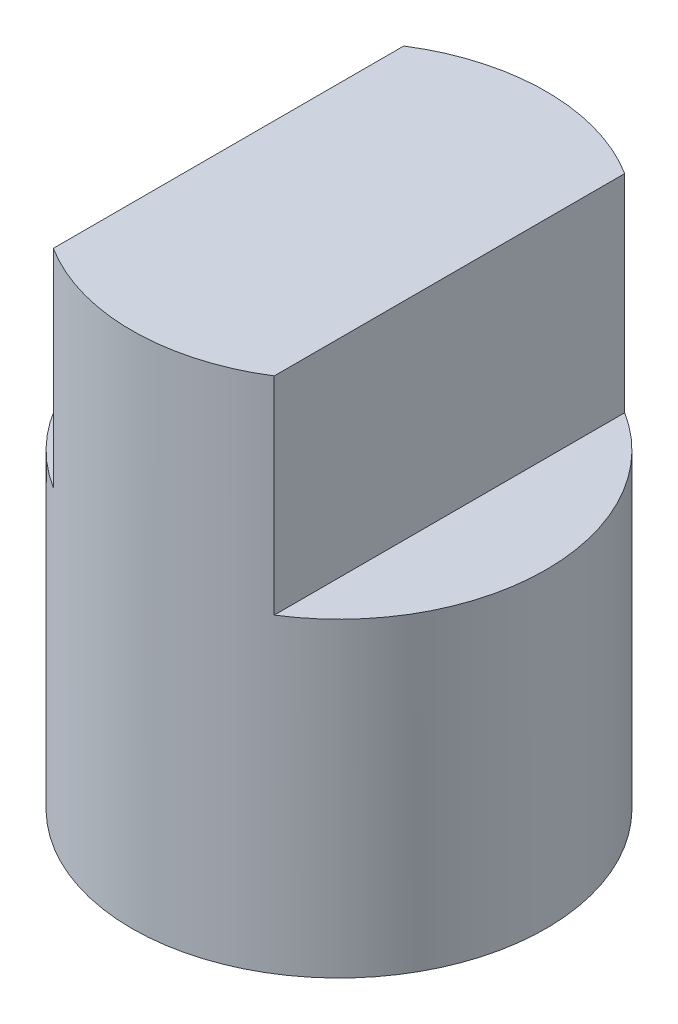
ISO-10303-21;
HEADER;
FILE_DESCRIPTION(('STEP AP214'),'2;1');
FILE_NAME('part.step','',(''),(''),'','','');
FILE_SCHEMA(('AUTOMOTIVE_DESIGN { 1 0 10303 214 1 1 1 1 }'));
ENDSEC;
DATA;
#1=APPLICATION_CONTEXT('core data for automotive mechanical design processes');
#2=APPLICATION_PROTOCOL_DEFINITION('international standard','automotive_design',2000,#1);
#3=PRODUCT_CONTEXT('',#1,'mechanical');
#4=PRODUCT('Part','Part','',(#3));
#5=PRODUCT_RELATED_PRODUCT_CATEGORY('part','',(#4));
#6=PRODUCT_DEFINITION_FORMATION('','',#4);
#7=PRODUCT_DEFINITION_CONTEXT('part definition',#1,'design');
#8=PRODUCT_DEFINITION('design','',#6,#7);
#9=PRODUCT_DEFINITION_SHAPE('','',#8);
#10=(LENGTH_UNIT() NAMED_UNIT(*) SI_UNIT(.MILLI.,.METRE.));
#11=(NAMED_UNIT(*) PLANE_ANGLE_UNIT() SI_UNIT($,.RADIAN.));
#12=(NAMED_UNIT(*) SI_UNIT($,.STERADIAN.) SOLID_ANGLE_UNIT());
#13=UNCERTAINTY_MEASURE_WITH_UNIT(LENGTH_MEASURE(1.E-05),#10,'distance_accuracy_value','');
#14=(GEOMETRIC_REPRESENTATION_CONTEXT(3) GLOBAL_UNCERTAINTY_ASSIGNED_CONTEXT((#13)) GLOBAL_UNIT_ASSIGNED_CONTEXT((#10,
#11,#12)) REPRESENTATION_CONTEXT('',''));
#15=CARTESIAN_POINT('',(0.,0.,0.));
#16=DIRECTION('',(0.,0.,1.));
#17=DIRECTION('',(1.,0.,0.));
#18=AXIS2_PLACEMENT_3D('',#15,#16,#17);
#19=CARTESIAN_POINT('',(0.,75.,0.));
#20=DIRECTION('',(0.,-1.,0.));
#21=DIRECTION('',(0.,0.,-1.));
#22=AXIS2_PLACEMENT_3D('',#19,#20,#21);
#23=CYLINDRICAL_SURFACE('',#22,30.);
#24=CARTESIAN_POINT('',(0.,75.,0.));
#25=DIRECTION('',(0.,1.,0.));
#26=DIRECTION('',(0.,0.,1.));
#27=AXIS2_PLACEMENT_3D('',#24,#25,#26);
#28=CIRCLE('',#27,30.);
#29=CARTESIAN_POINT('',(16.,75.,-25.377155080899));
#30=VERTEX_POINT('',#29);
#31=CARTESIAN_POINT('',(-16.,75.,-25.377155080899));
#32=VERTEX_POINT('',#31);
#33=EDGE_CURVE('E39',#30,#32,#28,.T.);
#34=ORIENTED_EDGE('',*,*,#33,.F.);
#35=DIRECTION('',(0.,1.,0.));
#36=VECTOR('',#35,1.);
#37=CARTESIAN_POINT('',(16.,45.,-25.377155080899));
#38=LINE('',#37,#36);
#39=CARTESIAN_POINT('',(16.,45.,-25.377155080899));
#40=VERTEX_POINT('',#39);
#41=EDGE_CURVE('E46',#40,#30,#38,.T.);
#42=ORIENTED_EDGE('',*,*,#41,.F.);
#43=CARTESIAN_POINT('',(0.,45.,0.));
#44=DIRECTION('',(0.,1.,0.));
#45=DIRECTION('',(0.,0.,1.));
#46=AXIS2_PLACEMENT_3D('',#43,#44,#45);
#47=CIRCLE('',#46,30.);
#48=CARTESIAN_POINT('',(16.,45.,25.377155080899));
#49=VERTEX_POINT('',#48);
#50=EDGE_CURVE('E75',#49,#40,#47,.T.);
#51=ORIENTED_EDGE('',*,*,#50,.F.);
#52=DIRECTION('',(0.,1.,0.));
#53=VECTOR('',#52,1.);
#54=CARTESIAN_POINT('',(16.,45.,25.377155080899));
#55=LINE('',#54,#53);
#56=CARTESIAN_POINT('',(16.,75.,25.377155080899));
#57=VERTEX_POINT('',#56);
#58=EDGE_CURVE('E83',#49,#57,#55,.T.);
#59=ORIENTED_EDGE('',*,*,#58,.T.);
#60=CARTESIAN_POINT('',(-16.,75.,25.377155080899));
#61=VERTEX_POINT('',#60);
#62=EDGE_CURVE('E11',#61,#57,#28,.T.);
#63=ORIENTED_EDGE('',*,*,#62,.F.);
#64=DIRECTION('',(0.,1.,0.));
#65=VECTOR('',#64,1.);
#66=CARTESIAN_POINT('',(-16.,45.,25.377155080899));
#67=LINE('',#66,#65);
#68=CARTESIAN_POINT('',(-16.,45.,25.377155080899));
#69=VERTEX_POINT('',#68);
#70=EDGE_CURVE('E54',#69,#61,#67,.T.);
#71=ORIENTED_EDGE('',*,*,#70,.F.);
#72=CARTESIAN_POINT('',(0.,45.,0.));
#73=DIRECTION('',(0.,1.,0.));
#74=DIRECTION('',(0.,0.,1.));
#75=AXIS2_PLACEMENT_3D('',#72,#73,#74);
#76=CIRCLE('',#75,30.);
#77=CARTESIAN_POINT('',(-16.,45.,-25.377155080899));
#78=VERTEX_POINT('',#77);
#79=EDGE_CURVE('E93',#78,#69,#76,.T.);
#80=ORIENTED_EDGE('',*,*,#79,.F.);
#81=DIRECTION('',(0.,1.,0.));
#82=VECTOR('',#81,1.);
#83=CARTESIAN_POINT('',(-16.,45.,-25.377155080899));
#84=LINE('',#83,#82);
#85=EDGE_CURVE('E99',#78,#32,#84,.T.);
#86=ORIENTED_EDGE('',*,*,#85,.T.);
#87=EDGE_LOOP('',(#34,#42,#51,#59,#63,#71,#80,#86));
#88=FACE_BOUND('',#87,.T.);
#89=CARTESIAN_POINT('',(0.,0.,0.));
#90=DIRECTION('',(0.,1.,0.));
#91=DIRECTION('',(0.,0.,1.));
#92=AXIS2_PLACEMENT_3D('',#89,#90,#91);
#93=CIRCLE('',#92,30.);
#94=CARTESIAN_POINT('',(0.,0.,30.));
#95=VERTEX_POINT('',#94);
#96=EDGE_CURVE('E34',#95,#95,#93,.T.);
#97=ORIENTED_EDGE('',*,*,#96,.T.);
#98=EDGE_LOOP('',(#97));
#99=FACE_BOUND('',#98,.T.);
#100=ADVANCED_FACE('F31',(#88,#99),#23,.T.);
#101=CARTESIAN_POINT('',(0.,75.,0.));
#102=DIRECTION('',(0.,1.,0.));
#103=DIRECTION('',(0.,0.,1.));
#104=AXIS2_PLACEMENT_3D('',#101,#102,#103);
#105=PLANE('',#104);
#106=DIRECTION('',(0.,0.,1.));
#107=VECTOR('',#106,1.);
#108=CARTESIAN_POINT('',(16.,75.,-25.377155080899));
#109=LINE('',#108,#107);
#110=EDGE_CURVE('E80',#30,#57,#109,.T.);
#111=ORIENTED_EDGE('',*,*,#110,.F.);
#112=ORIENTED_EDGE('',*,*,#33,.T.);
#113=DIRECTION('',(0.,0.,-1.));
#114=VECTOR('',#113,1.);
#115=CARTESIAN_POINT('',(-16.,75.,25.377155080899));
#116=LINE('',#115,#114);
#117=EDGE_CURVE('E89',#61,#32,#116,.T.);
#118=ORIENTED_EDGE('',*,*,#117,.F.);
#119=ORIENTED_EDGE('',*,*,#62,.T.);
#120=EDGE_LOOP('',(#111,#112,#118,#119));
#121=FACE_BOUND('',#120,.T.);
#122=ADVANCED_FACE('F105',(#121),#105,.T.);
#123=CARTESIAN_POINT('',(0.,0.,0.));
#124=DIRECTION('',(0.,1.,0.));
#125=DIRECTION('',(0.,0.,1.));
#126=AXIS2_PLACEMENT_3D('',#123,#124,#125);
#127=PLANE('',#126);
#128=ORIENTED_EDGE('',*,*,#96,.F.);
#129=EDGE_LOOP('',(#128));
#130=FACE_BOUND('',#129,.T.);
#131=ADVANCED_FACE('F117',(#130),#127,.F.);
#132=CARTESIAN_POINT('',(-16.,45.,25.377155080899));
#133=DIRECTION('',(1.,0.,0.));
#134=DIRECTION('',(0.,0.,-1.));
#135=AXIS2_PLACEMENT_3D('',#132,#133,#134);
#136=PLANE('',#135);
#137=ORIENTED_EDGE('',*,*,#117,.T.);
#138=ORIENTED_EDGE('',*,*,#85,.F.);
#139=DIRECTION('',(0.,0.,-1.));
#140=VECTOR('',#139,1.);
#141=CARTESIAN_POINT('',(-16.,45.,25.377155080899));
#142=LINE('',#141,#140);
#143=EDGE_CURVE('E95',#69,#78,#142,.T.);
#144=ORIENTED_EDGE('',*,*,#143,.F.);
#145=ORIENTED_EDGE('',*,*,#70,.T.);
#146=EDGE_LOOP('',(#137,#138,#144,#145));
#147=FACE_BOUND('',#146,.T.);
#148=ADVANCED_FACE('F107',(#147),#136,.F.);
#149=CARTESIAN_POINT('',(0.,45.,0.));
#150=DIRECTION('',(0.,1.,0.));
#151=DIRECTION('',(0.,0.,1.));
#152=AXIS2_PLACEMENT_3D('',#149,#150,#151);
#153=PLANE('',#152);
#154=ORIENTED_EDGE('',*,*,#79,.T.);
#155=ORIENTED_EDGE('',*,*,#143,.T.);
#156=EDGE_LOOP('',(#154,#155));
#157=FACE_BOUND('',#156,.T.);
#158=ADVANCED_FACE('F109',(#157),#153,.T.);
#159=CARTESIAN_POINT('',(16.,45.,-25.377155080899));
#160=DIRECTION('',(-1.,0.,0.));
#161=DIRECTION('',(0.,0.,1.));
#162=AXIS2_PLACEMENT_3D('',#159,#160,#161);
#163=PLANE('',#162);
#164=ORIENTED_EDGE('',*,*,#110,.T.);
#165=ORIENTED_EDGE('',*,*,#58,.F.);
#166=DIRECTION('',(0.,0.,1.));
#167=VECTOR('',#166,1.);
#168=CARTESIAN_POINT('',(16.,45.,-25.377155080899));
#169=LINE('',#168,#167);
#170=EDGE_CURVE('E77',#40,#49,#169,.T.);
#171=ORIENTED_EDGE('',*,*,#170,.F.);
#172=ORIENTED_EDGE('',*,*,#41,.T.);
#173=EDGE_LOOP('',(#164,#165,#171,#172));
#174=FACE_BOUND('',#173,.T.);
#175=ADVANCED_FACE('F82',(#174),#163,.F.);
#176=CARTESIAN_POINT('',(0.,45.,0.));
#177=DIRECTION('',(0.,1.,0.));
#178=DIRECTION('',(0.,0.,1.));
#179=AXIS2_PLACEMENT_3D('',#176,#177,#178);
#180=PLANE('',#179);
#181=ORIENTED_EDGE('',*,*,#50,.T.);
#182=ORIENTED_EDGE('',*,*,#170,.T.);
#183=EDGE_LOOP('',(#181,#182));
#184=FACE_BOUND('',#183,.T.);
#185=ADVANCED_FACE('F76',(#184),#180,.T.);
#186=CLOSED_SHELL('',(#100,#122,#131,#148,#158,#175,#185));
#187=MANIFOLD_SOLID_BREP('B2',#186);
#188=ADVANCED_BREP_SHAPE_REPRESENTATION('',(#18,#187),#14);
#189=SHAPE_DEFINITION_REPRESENTATION(#9,#188);
ENDSEC;
END-ISO-10303-21;
